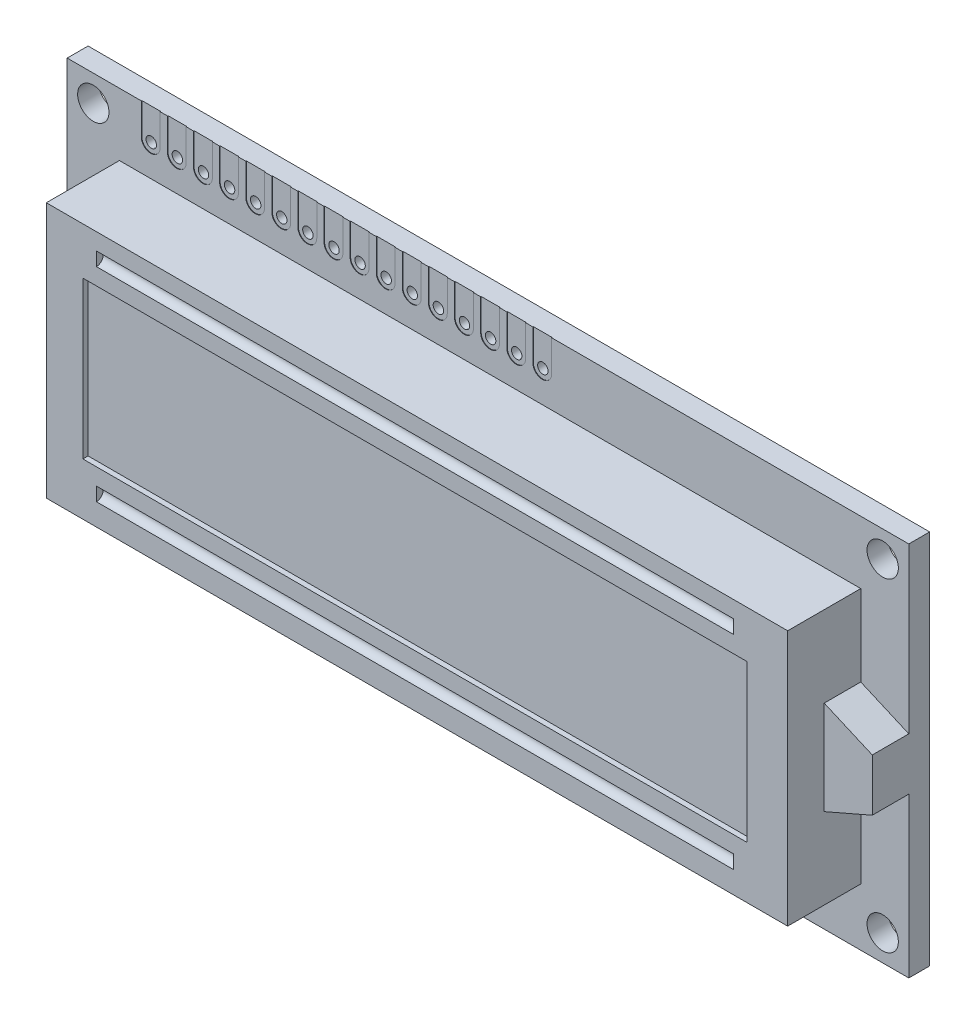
from build123d import *

# Parameters (mm, degrees)
CROQUIS1_W                 = 80.6
CROQUIS1_H                 = 36
CROQUIS1_R                 = 1.5
SALIENTE_EXTRUIR1_DEPTH    = 2
CROQUIS2_W                 = 71
CROQUIS2_H                 = 24.5
SALIENTE_EXTRUIR2_DEPTH    = 7
CROQUIS3_W                 = 63.6
CROQUIS3_H                 = 15
CORTAR_EXTRUIR1_DEPTH      = 0.5
CORTAR_EXTRUIR2_DEPTH      = 30.5
CORTAR_EXTRUIR2_DEPTH_BACK = 30.5
SALIENTE_EXTRUIR3_DEPTH    = 3.5
CROQUIS6_R                 = 0.5
CORTAR_EXTRUIR3_DEPTH      = 3.5
CROQUIS8_R                 = 0.5
CORTAR_EXTRUIR4_DEPTH      = 0.05
MATRIZL1_COUNT             = 16
MATRIZL1_PITCH             = 2.5


with BuildPart() as part:
    # Croquis1 → Saliente-Extruir1 (new body)
    with BuildSketch(Plane.XY):
        Rectangle(CROQUIS1_W, CROQUIS1_H)
        with Locations((37.8, 15.5)):
            Circle(CROQUIS1_R, mode=Mode.SUBTRACT)
        with Locations(Location((-37.8, 15.5, 0), (0, 0, 180))):
            Circle(CROQUIS1_R, mode=Mode.SUBTRACT)
        with Locations(Location((37.8, -15.5, 0), (0, 0, 180))):
            Circle(CROQUIS1_R, mode=Mode.SUBTRACT)
        with Locations((-37.8, -15.5)):
            Circle(CROQUIS1_R, mode=Mode.SUBTRACT)
    extrude(amount=SALIENTE_EXTRUIR1_DEPTH)

    # Croquis2 → Saliente-Extruir2 (add)
    with BuildSketch(Plane.XY.offset(2)):
        with Locations((0.2, -0.25)):
            Rectangle(CROQUIS2_W, CROQUIS2_H)
    extrude(amount=SALIENTE_EXTRUIR2_DEPTH)

    # Croquis3 → Cortar-Extruir1 (cut)
    with BuildSketch(Plane.XY.offset(9)):
        Rectangle(CROQUIS3_W, CROQUIS3_H)
    extrude(amount=-CORTAR_EXTRUIR1_DEPTH, mode=Mode.SUBTRACT)

    # Croquis4 → Cortar-Extruir2 (cut, two sides: drawn at the far end of the back side and taken through both)
    with BuildSketch(Plane(origin=(0, 0, 0), x_dir=(0, 0, -1), z_dir=(1, 0, 0)).offset(-CORTAR_EXTRUIR2_DEPTH_BACK)):
        with BuildLine():
            Line((-9, 10.401372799), (-9, 9.098123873))
            ThreePointArc((-9, 9.098123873), (-8.348627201, 9.75), (-9, 10.401372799))
        make_face()
        with BuildLine():
            ThreePointArc((-9, -9.098627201), (-8.348627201, -9.75), (-9, -10.401372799))
            Line((-9, -10.401372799), (-9, -9.098627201))
        make_face()
    extrude(amount=CORTAR_EXTRUIR2_DEPTH + CORTAR_EXTRUIR2_DEPTH_BACK, mode=Mode.SUBTRACT)

    # Croquis5 → Saliente-Extruir3 (add)
    with BuildSketch(Plane.XY.offset(2)):
        Polygon((35.7, 4.25), (40.3, 2.25), (40.3, -2.75), (35.7, -4.75), align=None)
    extrude(amount=SALIENTE_EXTRUIR3_DEPTH)

    # Croquis6 → Cortar-Extruir3 (cut)
    with BuildSketch(Plane.XY.offset(2)):
        with Locations((-32.3, 15)):
            Circle(CROQUIS6_R)
        with Locations((-29.8, 15)):
            Circle(CROQUIS6_R)
        with Locations((-27.3, 15)):
            Circle(CROQUIS6_R)
        with Locations((-24.8, 15)):
            Circle(CROQUIS6_R)
        with Locations((-22.3, 15)):
            Circle(CROQUIS6_R)
        with Locations((-19.8, 15)):
            Circle(CROQUIS6_R)
        with Locations((-17.3, 15)):
            Circle(CROQUIS6_R)
        with Locations((-14.8, 15)):
            Circle(CROQUIS6_R)
        with Locations((-12.3, 15)):
            Circle(CROQUIS6_R)
        with Locations((-9.8, 15)):
            Circle(CROQUIS6_R)
        with Locations((-7.3, 15)):
            Circle(CROQUIS6_R)
        with Locations((-4.8, 15)):
            Circle(CROQUIS6_R)
        with Locations((-2.3, 15)):
            Circle(CROQUIS6_R)
        with Locations((0.2, 15)):
            Circle(CROQUIS6_R)
        with Locations((2.7, 15)):
            Circle(CROQUIS6_R)
        with Locations((5.2, 15)):
            Circle(CROQUIS6_R)
    extrude(amount=-CORTAR_EXTRUIR3_DEPTH, mode=Mode.SUBTRACT)

    # Croquis8 → Cortar-Extruir4 (cut)
    with BuildSketch(Plane.XY.offset(2)):
        with BuildLine():
            Line((-33.2, 15), (-33.2, 18))
            Line((-33.2, 18), (-31.4, 18))
            Line((-31.4, 18), (-31.4, 15))
            ThreePointArc((-31.4, 15), (-32.3, 14.1), (-33.2, 15))
        make_face()
        with Locations((-32.3, 15)):
            Circle(CROQUIS8_R, mode=Mode.SUBTRACT)
    cortar_extruir4 = extrude(amount=-CORTAR_EXTRUIR4_DEPTH, mode=Mode.SUBTRACT)

    # MatrizL1: Cortar-Extruir4 ×16
    with Locations(*[(i * MATRIZL1_PITCH, 0, 0) for i in range(1, MATRIZL1_COUNT)]):
        add(cortar_extruir4, mode=Mode.SUBTRACT)


solid = part.part
